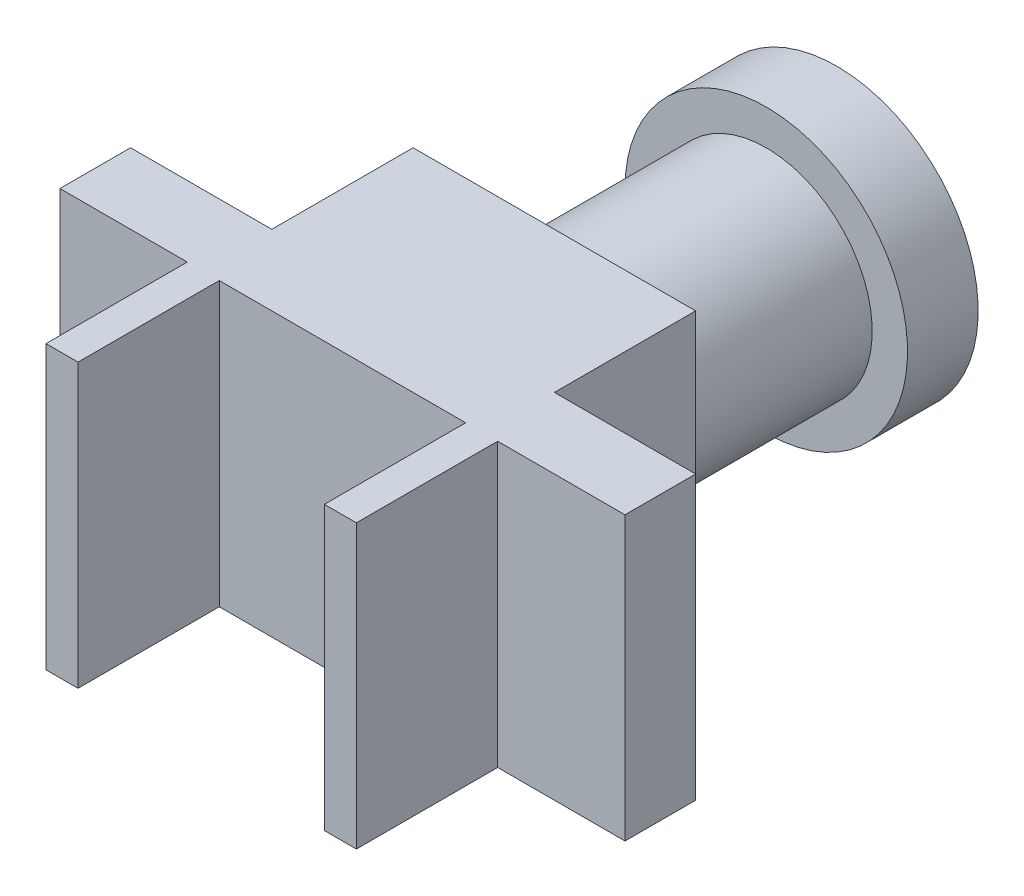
ISO-10303-21;
HEADER;
FILE_DESCRIPTION(('STEP AP214'),'2;1');
FILE_NAME('part.step','',(''),(''),'','','');
FILE_SCHEMA(('AUTOMOTIVE_DESIGN { 1 0 10303 214 1 1 1 1 }'));
ENDSEC;
DATA;
#1=APPLICATION_CONTEXT('core data for automotive mechanical design processes');
#2=APPLICATION_PROTOCOL_DEFINITION('international standard','automotive_design',2000,#1);
#3=PRODUCT_CONTEXT('',#1,'mechanical');
#4=PRODUCT('Part','Part','',(#3));
#5=PRODUCT_RELATED_PRODUCT_CATEGORY('part','',(#4));
#6=PRODUCT_DEFINITION_FORMATION('','',#4);
#7=PRODUCT_DEFINITION_CONTEXT('part definition',#1,'design');
#8=PRODUCT_DEFINITION('design','',#6,#7);
#9=PRODUCT_DEFINITION_SHAPE('','',#8);
#10=(LENGTH_UNIT() NAMED_UNIT(*) SI_UNIT(.MILLI.,.METRE.));
#11=(NAMED_UNIT(*) PLANE_ANGLE_UNIT() SI_UNIT($,.RADIAN.));
#12=(NAMED_UNIT(*) SI_UNIT($,.STERADIAN.) SOLID_ANGLE_UNIT());
#13=UNCERTAINTY_MEASURE_WITH_UNIT(LENGTH_MEASURE(1.E-05),#10,'distance_accuracy_value','');
#14=(GEOMETRIC_REPRESENTATION_CONTEXT(3) GLOBAL_UNCERTAINTY_ASSIGNED_CONTEXT((#13)) GLOBAL_UNIT_ASSIGNED_CONTEXT((#10,
#11,#12)) REPRESENTATION_CONTEXT('',''));
#15=CARTESIAN_POINT('',(0.,0.,0.));
#16=DIRECTION('',(0.,0.,1.));
#17=DIRECTION('',(1.,0.,0.));
#18=AXIS2_PLACEMENT_3D('',#15,#16,#17);
#19=CARTESIAN_POINT('',(0.,0.,45.));
#20=DIRECTION('',(0.,0.,-1.));
#21=DIRECTION('',(-1.,0.,0.));
#22=AXIS2_PLACEMENT_3D('',#19,#20,#21);
#23=PLANE('',#22);
#24=DIRECTION('',(-1.,0.,0.));
#25=VECTOR('',#24,1.);
#26=CARTESIAN_POINT('',(40.,20.,45.));
#27=LINE('',#26,#25);
#28=CARTESIAN_POINT('',(40.,20.,45.));
#29=VERTEX_POINT('',#28);
#30=CARTESIAN_POINT('',(21.9709349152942,20.,45.));
#31=VERTEX_POINT('',#30);
#32=EDGE_CURVE('E213',#29,#31,#27,.T.);
#33=ORIENTED_EDGE('',*,*,#32,.T.);
#34=DIRECTION('',(0.,-1.,0.));
#35=VECTOR('',#34,1.);
#36=CARTESIAN_POINT('',(21.9709349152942,20.,45.));
#37=LINE('',#36,#35);
#38=CARTESIAN_POINT('',(21.9709349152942,-20.,45.));
#39=VERTEX_POINT('',#38);
#40=EDGE_CURVE('E51',#31,#39,#37,.T.);
#41=ORIENTED_EDGE('',*,*,#40,.T.);
#42=DIRECTION('',(1.,0.,0.));
#43=VECTOR('',#42,1.);
#44=CARTESIAN_POINT('',(40.,-20.,45.));
#45=LINE('',#44,#43);
#46=CARTESIAN_POINT('',(40.,-20.,45.));
#47=VERTEX_POINT('',#46);
#48=EDGE_CURVE('E37',#39,#47,#45,.T.);
#49=ORIENTED_EDGE('',*,*,#48,.T.);
#50=DIRECTION('',(0.,1.,0.));
#51=VECTOR('',#50,1.);
#52=CARTESIAN_POINT('',(40.,20.,45.));
#53=LINE('',#52,#51);
#54=EDGE_CURVE('E218',#47,#29,#53,.T.);
#55=ORIENTED_EDGE('',*,*,#54,.T.);
#56=EDGE_LOOP('',(#33,#41,#49,#55));
#57=FACE_BOUND('',#56,.T.);
#58=ADVANCED_FACE('F33',(#57),#23,.F.);
#59=DIRECTION('',(0.,-1.,0.));
#60=VECTOR('',#59,1.);
#61=CARTESIAN_POINT('',(-21.9709349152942,20.,45.));
#62=LINE('',#61,#60);
#63=CARTESIAN_POINT('',(-21.9709349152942,20.,45.));
#64=VERTEX_POINT('',#63);
#65=CARTESIAN_POINT('',(-21.9709349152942,-20.,45.));
#66=VERTEX_POINT('',#65);
#67=EDGE_CURVE('E159',#64,#66,#62,.T.);
#68=ORIENTED_EDGE('',*,*,#67,.F.);
#69=CARTESIAN_POINT('',(-40.,20.,45.));
#70=VERTEX_POINT('',#69);
#71=EDGE_CURVE('E214',#64,#70,#27,.T.);
#72=ORIENTED_EDGE('',*,*,#71,.T.);
#73=DIRECTION('',(0.,-1.,0.));
#74=VECTOR('',#73,1.);
#75=CARTESIAN_POINT('',(-40.,20.,45.));
#76=LINE('',#75,#74);
#77=CARTESIAN_POINT('',(-40.,-20.,45.));
#78=VERTEX_POINT('',#77);
#79=EDGE_CURVE('E232',#70,#78,#76,.T.);
#80=ORIENTED_EDGE('',*,*,#79,.T.);
#81=EDGE_CURVE('E229',#78,#66,#45,.T.);
#82=ORIENTED_EDGE('',*,*,#81,.T.);
#83=EDGE_LOOP('',(#68,#72,#80,#82));
#84=FACE_BOUND('',#83,.T.);
#85=ADVANCED_FACE('F371',(#84),#23,.F.);
#86=CARTESIAN_POINT('',(-17.4394295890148,-20.,45.));
#87=VERTEX_POINT('',#86);
#88=CARTESIAN_POINT('',(17.4394295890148,-20.,45.));
#89=VERTEX_POINT('',#88);
#90=EDGE_CURVE('E59',#87,#89,#45,.T.);
#91=ORIENTED_EDGE('',*,*,#90,.T.);
#92=DIRECTION('',(0.,1.,0.));
#93=VECTOR('',#92,1.);
#94=CARTESIAN_POINT('',(17.4394295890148,20.,45.));
#95=LINE('',#94,#93);
#96=CARTESIAN_POINT('',(17.4394295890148,20.,45.));
#97=VERTEX_POINT('',#96);
#98=EDGE_CURVE('E170',#89,#97,#95,.T.);
#99=ORIENTED_EDGE('',*,*,#98,.T.);
#100=CARTESIAN_POINT('',(-17.4394295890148,20.,45.));
#101=VERTEX_POINT('',#100);
#102=EDGE_CURVE('E211',#97,#101,#27,.T.);
#103=ORIENTED_EDGE('',*,*,#102,.T.);
#104=DIRECTION('',(0.,1.,0.));
#105=VECTOR('',#104,1.);
#106=CARTESIAN_POINT('',(-17.4394295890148,20.,45.));
#107=LINE('',#106,#105);
#108=EDGE_CURVE('E190',#87,#101,#107,.T.);
#109=ORIENTED_EDGE('',*,*,#108,.F.);
#110=EDGE_LOOP('',(#91,#99,#103,#109));
#111=FACE_BOUND('',#110,.T.);
#112=ADVANCED_FACE('F369',(#111),#23,.F.);
#113=CARTESIAN_POINT('',(0.,0.,15.));
#114=DIRECTION('',(0.,0.,-1.));
#115=DIRECTION('',(-1.,0.,0.));
#116=AXIS2_PLACEMENT_3D('',#113,#114,#115);
#117=CYLINDRICAL_SURFACE('',#116,15.);
#118=CARTESIAN_POINT('',(0.,0.,15.));
#119=DIRECTION('',(0.,0.,1.));
#120=DIRECTION('',(1.,0.,0.));
#121=AXIS2_PLACEMENT_3D('',#118,#119,#120);
#122=CIRCLE('',#121,15.);
#123=CARTESIAN_POINT('',(15.,0.,15.));
#124=VERTEX_POINT('',#123);
#125=EDGE_CURVE('E11',#124,#124,#122,.T.);
#126=ORIENTED_EDGE('',*,*,#125,.F.);
#127=EDGE_LOOP('',(#126));
#128=FACE_BOUND('',#127,.T.);
#129=CARTESIAN_POINT('',(0.,0.,-15.));
#130=DIRECTION('',(0.,0.,-1.));
#131=DIRECTION('',(-1.,0.,0.));
#132=AXIS2_PLACEMENT_3D('',#129,#130,#131);
#133=CIRCLE('',#132,15.);
#134=CARTESIAN_POINT('',(-15.,0.,-15.));
#135=VERTEX_POINT('',#134);
#136=EDGE_CURVE('E43',#135,#135,#133,.T.);
#137=ORIENTED_EDGE('',*,*,#136,.F.);
#138=EDGE_LOOP('',(#137));
#139=FACE_BOUND('',#138,.T.);
#140=ADVANCED_FACE('F35',(#128,#139),#117,.T.);
#141=CARTESIAN_POINT('',(0.,0.,-15.));
#142=DIRECTION('',(0.,0.,-1.));
#143=DIRECTION('',(-1.,0.,0.));
#144=AXIS2_PLACEMENT_3D('',#141,#142,#143);
#145=PLANE('',#144);
#146=CARTESIAN_POINT('',(0.,0.,-15.));
#147=DIRECTION('',(0.,0.,-1.));
#148=DIRECTION('',(-1.,0.,0.));
#149=AXIS2_PLACEMENT_3D('',#146,#147,#148);
#150=CIRCLE('',#149,20.);
#151=CARTESIAN_POINT('',(-20.,0.,-15.));
#152=VERTEX_POINT('',#151);
#153=EDGE_CURVE('E290',#152,#152,#150,.T.);
#154=ORIENTED_EDGE('',*,*,#153,.F.);
#155=EDGE_LOOP('',(#154));
#156=FACE_BOUND('',#155,.T.);
#157=ORIENTED_EDGE('',*,*,#136,.T.);
#158=EDGE_LOOP('',(#157));
#159=FACE_BOUND('',#158,.T.);
#160=ADVANCED_FACE('F377',(#156,#159),#145,.F.);
#161=CARTESIAN_POINT('',(0.,0.,-25.));
#162=DIRECTION('',(0.,0.,1.));
#163=DIRECTION('',(1.,0.,0.));
#164=AXIS2_PLACEMENT_3D('',#161,#162,#163);
#165=CYLINDRICAL_SURFACE('',#164,20.);
#166=CARTESIAN_POINT('',(0.,0.,-25.));
#167=DIRECTION('',(0.,0.,-1.));
#168=DIRECTION('',(-1.,0.,0.));
#169=AXIS2_PLACEMENT_3D('',#166,#167,#168);
#170=CIRCLE('',#169,20.);
#171=CARTESIAN_POINT('',(-20.,0.,-25.));
#172=VERTEX_POINT('',#171);
#173=EDGE_CURVE('E287',#172,#172,#170,.T.);
#174=ORIENTED_EDGE('',*,*,#173,.F.);
#175=EDGE_LOOP('',(#174));
#176=FACE_BOUND('',#175,.T.);
#177=ORIENTED_EDGE('',*,*,#153,.T.);
#178=EDGE_LOOP('',(#177));
#179=FACE_BOUND('',#178,.T.);
#180=ADVANCED_FACE('F500',(#176,#179),#165,.T.);
#181=CARTESIAN_POINT('',(0.,0.,-25.));
#182=DIRECTION('',(0.,0.,-1.));
#183=DIRECTION('',(-1.,0.,0.));
#184=AXIS2_PLACEMENT_3D('',#181,#182,#183);
#185=PLANE('',#184);
#186=ORIENTED_EDGE('',*,*,#173,.T.);
#187=EDGE_LOOP('',(#186));
#188=FACE_BOUND('',#187,.T.);
#189=ADVANCED_FACE('F491',(#188),#185,.T.);
#190=CARTESIAN_POINT('',(0.,0.,15.));
#191=DIRECTION('',(0.,0.,-1.));
#192=DIRECTION('',(-1.,0.,0.));
#193=AXIS2_PLACEMENT_3D('',#190,#191,#192);
#194=PLANE('',#193);
#195=DIRECTION('',(0.,-1.,0.));
#196=VECTOR('',#195,1.);
#197=CARTESIAN_POINT('',(-20.,20.,15.));
#198=LINE('',#197,#196);
#199=CARTESIAN_POINT('',(-20.,20.,15.));
#200=VERTEX_POINT('',#199);
#201=CARTESIAN_POINT('',(-20.,-20.,15.));
#202=VERTEX_POINT('',#201);
#203=EDGE_CURVE('E267',#200,#202,#198,.T.);
#204=ORIENTED_EDGE('',*,*,#203,.F.);
#205=DIRECTION('',(-1.,0.,0.));
#206=VECTOR('',#205,1.);
#207=CARTESIAN_POINT('',(20.,20.,15.));
#208=LINE('',#207,#206);
#209=CARTESIAN_POINT('',(20.,20.,15.));
#210=VERTEX_POINT('',#209);
#211=EDGE_CURVE('E284',#210,#200,#208,.T.);
#212=ORIENTED_EDGE('',*,*,#211,.F.);
#213=DIRECTION('',(0.,1.,0.));
#214=VECTOR('',#213,1.);
#215=CARTESIAN_POINT('',(20.,20.,15.));
#216=LINE('',#215,#214);
#217=CARTESIAN_POINT('',(20.,-20.,15.));
#218=VERTEX_POINT('',#217);
#219=EDGE_CURVE('E277',#218,#210,#216,.T.);
#220=ORIENTED_EDGE('',*,*,#219,.F.);
#221=DIRECTION('',(1.,0.,0.));
#222=VECTOR('',#221,1.);
#223=CARTESIAN_POINT('',(20.,-20.,15.));
#224=LINE('',#223,#222);
#225=EDGE_CURVE('E272',#202,#218,#224,.T.);
#226=ORIENTED_EDGE('',*,*,#225,.F.);
#227=EDGE_LOOP('',(#204,#212,#220,#226));
#228=FACE_BOUND('',#227,.T.);
#229=ORIENTED_EDGE('',*,*,#125,.T.);
#230=EDGE_LOOP('',(#229));
#231=FACE_BOUND('',#230,.T.);
#232=ADVANCED_FACE('F330',(#228,#231),#194,.T.);
#233=CARTESIAN_POINT('',(-20.,20.,35.));
#234=DIRECTION('',(1.,0.,0.));
#235=DIRECTION('',(0.,1.,0.));
#236=AXIS2_PLACEMENT_3D('',#233,#234,#235);
#237=PLANE('',#236);
#238=ORIENTED_EDGE('',*,*,#203,.T.);
#239=DIRECTION('',(0.,0.,-1.));
#240=VECTOR('',#239,1.);
#241=CARTESIAN_POINT('',(-20.,-20.,35.));
#242=LINE('',#241,#240);
#243=CARTESIAN_POINT('',(-20.,-20.,35.));
#244=VERTEX_POINT('',#243);
#245=EDGE_CURVE('E293',#244,#202,#242,.T.);
#246=ORIENTED_EDGE('',*,*,#245,.F.);
#247=DIRECTION('',(0.,-1.,0.));
#248=VECTOR('',#247,1.);
#249=CARTESIAN_POINT('',(-20.,20.,35.));
#250=LINE('',#249,#248);
#251=CARTESIAN_POINT('',(-20.,20.,35.));
#252=VERTEX_POINT('',#251);
#253=EDGE_CURVE('E286',#252,#244,#250,.T.);
#254=ORIENTED_EDGE('',*,*,#253,.F.);
#255=DIRECTION('',(0.,0.,-1.));
#256=VECTOR('',#255,1.);
#257=CARTESIAN_POINT('',(-20.,20.,35.));
#258=LINE('',#257,#256);
#259=EDGE_CURVE('E299',#252,#200,#258,.T.);
#260=ORIENTED_EDGE('',*,*,#259,.T.);
#261=EDGE_LOOP('',(#238,#246,#254,#260));
#262=FACE_BOUND('',#261,.T.);
#263=ADVANCED_FACE('F334',(#262),#237,.F.);
#264=CARTESIAN_POINT('',(20.,-20.,35.));
#265=DIRECTION('',(0.,1.,0.));
#266=DIRECTION('',(-1.,0.,0.));
#267=AXIS2_PLACEMENT_3D('',#264,#265,#266);
#268=PLANE('',#267);
#269=ORIENTED_EDGE('',*,*,#225,.T.);
#270=DIRECTION('',(0.,0.,-1.));
#271=VECTOR('',#270,1.);
#272=CARTESIAN_POINT('',(20.,-20.,35.));
#273=LINE('',#272,#271);
#274=CARTESIAN_POINT('',(20.,-20.,35.));
#275=VERTEX_POINT('',#274);
#276=EDGE_CURVE('E298',#275,#218,#273,.T.);
#277=ORIENTED_EDGE('',*,*,#276,.F.);
#278=DIRECTION('',(1.,0.,0.));
#279=VECTOR('',#278,1.);
#280=CARTESIAN_POINT('',(40.,-20.,35.));
#281=LINE('',#280,#279);
#282=CARTESIAN_POINT('',(40.,-20.,35.));
#283=VERTEX_POINT('',#282);
#284=EDGE_CURVE('E314',#275,#283,#281,.T.);
#285=ORIENTED_EDGE('',*,*,#284,.T.);
#286=DIRECTION('',(0.,0.,-1.));
#287=VECTOR('',#286,1.);
#288=CARTESIAN_POINT('',(40.,-20.,45.));
#289=LINE('',#288,#287);
#290=EDGE_CURVE('E260',#47,#283,#289,.T.);
#291=ORIENTED_EDGE('',*,*,#290,.F.);
#292=ORIENTED_EDGE('',*,*,#48,.F.);
#293=DIRECTION('',(0.,0.,-1.));
#294=VECTOR('',#293,1.);
#295=CARTESIAN_POINT('',(21.9709349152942,-20.,65.));
#296=LINE('',#295,#294);
#297=CARTESIAN_POINT('',(21.9709349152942,-20.,65.));
#298=VERTEX_POINT('',#297);
#299=EDGE_CURVE('E179',#298,#39,#296,.T.);
#300=ORIENTED_EDGE('',*,*,#299,.F.);
#301=DIRECTION('',(-1.,0.,0.));
#302=VECTOR('',#301,1.);
#303=CARTESIAN_POINT('',(21.9709349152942,-20.,65.));
#304=LINE('',#303,#302);
#305=CARTESIAN_POINT('',(17.4394295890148,-20.,65.));
#306=VERTEX_POINT('',#305);
#307=EDGE_CURVE('E169',#298,#306,#304,.T.);
#308=ORIENTED_EDGE('',*,*,#307,.T.);
#309=DIRECTION('',(0.,0.,-1.));
#310=VECTOR('',#309,1.);
#311=CARTESIAN_POINT('',(17.4394295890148,-20.,65.));
#312=LINE('',#311,#310);
#313=EDGE_CURVE('E183',#306,#89,#312,.T.);
#314=ORIENTED_EDGE('',*,*,#313,.T.);
#315=ORIENTED_EDGE('',*,*,#90,.F.);
#316=DIRECTION('',(0.,0.,-1.));
#317=VECTOR('',#316,1.);
#318=CARTESIAN_POINT('',(-17.4394295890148,-20.,65.));
#319=LINE('',#318,#317);
#320=CARTESIAN_POINT('',(-17.4394295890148,-20.,65.));
#321=VERTEX_POINT('',#320);
#322=EDGE_CURVE('E345',#321,#87,#319,.T.);
#323=ORIENTED_EDGE('',*,*,#322,.F.);
#324=DIRECTION('',(1.,0.,0.));
#325=VECTOR('',#324,1.);
#326=CARTESIAN_POINT('',(-21.9709349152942,-20.,65.));
#327=LINE('',#326,#325);
#328=CARTESIAN_POINT('',(-21.9709349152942,-20.,65.));
#329=VERTEX_POINT('',#328);
#330=EDGE_CURVE('E189',#329,#321,#327,.T.);
#331=ORIENTED_EDGE('',*,*,#330,.F.);
#332=DIRECTION('',(0.,0.,-1.));
#333=VECTOR('',#332,1.);
#334=CARTESIAN_POINT('',(-21.9709349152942,-20.,65.));
#335=LINE('',#334,#333);
#336=EDGE_CURVE('E343',#329,#66,#335,.T.);
#337=ORIENTED_EDGE('',*,*,#336,.T.);
#338=ORIENTED_EDGE('',*,*,#81,.F.);
#339=DIRECTION('',(0.,0.,-1.));
#340=VECTOR('',#339,1.);
#341=CARTESIAN_POINT('',(-40.,-20.,45.));
#342=LINE('',#341,#340);
#343=CARTESIAN_POINT('',(-40.,-20.,35.));
#344=VERTEX_POINT('',#343);
#345=EDGE_CURVE('E250',#78,#344,#342,.T.);
#346=ORIENTED_EDGE('',*,*,#345,.T.);
#347=EDGE_CURVE('E315',#344,#244,#281,.T.);
#348=ORIENTED_EDGE('',*,*,#347,.T.);
#349=ORIENTED_EDGE('',*,*,#245,.T.);
#350=EDGE_LOOP('',(#269,#277,#285,#291,#292,#300,#308,#314,#315,#323,#331,#337,#338,#346,#348,#349));
#351=FACE_BOUND('',#350,.T.);
#352=ADVANCED_FACE('F332',(#351),#268,.F.);
#353=CARTESIAN_POINT('',(20.,20.,35.));
#354=DIRECTION('',(-1.,0.,0.));
#355=DIRECTION('',(0.,-1.,0.));
#356=AXIS2_PLACEMENT_3D('',#353,#354,#355);
#357=PLANE('',#356);
#358=ORIENTED_EDGE('',*,*,#219,.T.);
#359=DIRECTION('',(0.,0.,-1.));
#360=VECTOR('',#359,1.);
#361=CARTESIAN_POINT('',(20.,20.,35.));
#362=LINE('',#361,#360);
#363=CARTESIAN_POINT('',(20.,20.,35.));
#364=VERTEX_POINT('',#363);
#365=EDGE_CURVE('E296',#364,#210,#362,.T.);
#366=ORIENTED_EDGE('',*,*,#365,.F.);
#367=DIRECTION('',(0.,1.,0.));
#368=VECTOR('',#367,1.);
#369=CARTESIAN_POINT('',(20.,20.,35.));
#370=LINE('',#369,#368);
#371=EDGE_CURVE('E302',#275,#364,#370,.T.);
#372=ORIENTED_EDGE('',*,*,#371,.F.);
#373=ORIENTED_EDGE('',*,*,#276,.T.);
#374=EDGE_LOOP('',(#358,#366,#372,#373));
#375=FACE_BOUND('',#374,.T.);
#376=ADVANCED_FACE('F326',(#375),#357,.F.);
#377=CARTESIAN_POINT('',(20.,20.,35.));
#378=DIRECTION('',(0.,-1.,0.));
#379=DIRECTION('',(1.,0.,0.));
#380=AXIS2_PLACEMENT_3D('',#377,#378,#379);
#381=PLANE('',#380);
#382=ORIENTED_EDGE('',*,*,#211,.T.);
#383=ORIENTED_EDGE('',*,*,#259,.F.);
#384=DIRECTION('',(-1.,0.,0.));
#385=VECTOR('',#384,1.);
#386=CARTESIAN_POINT('',(40.,20.,35.));
#387=LINE('',#386,#385);
#388=CARTESIAN_POINT('',(-40.,20.,35.));
#389=VERTEX_POINT('',#388);
#390=EDGE_CURVE('E241',#252,#389,#387,.T.);
#391=ORIENTED_EDGE('',*,*,#390,.T.);
#392=DIRECTION('',(0.,0.,-1.));
#393=VECTOR('',#392,1.);
#394=CARTESIAN_POINT('',(-40.,20.,45.));
#395=LINE('',#394,#393);
#396=EDGE_CURVE('E227',#70,#389,#395,.T.);
#397=ORIENTED_EDGE('',*,*,#396,.F.);
#398=ORIENTED_EDGE('',*,*,#71,.F.);
#399=DIRECTION('',(0.,0.,-1.));
#400=VECTOR('',#399,1.);
#401=CARTESIAN_POINT('',(-21.9709349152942,20.,65.));
#402=LINE('',#401,#400);
#403=CARTESIAN_POINT('',(-21.9709349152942,20.,65.));
#404=VERTEX_POINT('',#403);
#405=EDGE_CURVE('E196',#404,#64,#402,.T.);
#406=ORIENTED_EDGE('',*,*,#405,.F.);
#407=DIRECTION('',(-1.,0.,0.));
#408=VECTOR('',#407,1.);
#409=CARTESIAN_POINT('',(-21.9709349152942,20.,65.));
#410=LINE('',#409,#408);
#411=CARTESIAN_POINT('',(-17.4394295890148,20.,65.));
#412=VERTEX_POINT('',#411);
#413=EDGE_CURVE('E194',#412,#404,#410,.T.);
#414=ORIENTED_EDGE('',*,*,#413,.F.);
#415=DIRECTION('',(0.,0.,-1.));
#416=VECTOR('',#415,1.);
#417=CARTESIAN_POINT('',(-17.4394295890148,20.,65.));
#418=LINE('',#417,#416);
#419=EDGE_CURVE('E209',#412,#101,#418,.T.);
#420=ORIENTED_EDGE('',*,*,#419,.T.);
#421=ORIENTED_EDGE('',*,*,#102,.F.);
#422=DIRECTION('',(0.,0.,-1.));
#423=VECTOR('',#422,1.);
#424=CARTESIAN_POINT('',(17.4394295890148,20.,65.));
#425=LINE('',#424,#423);
#426=CARTESIAN_POINT('',(17.4394295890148,20.,65.));
#427=VERTEX_POINT('',#426);
#428=EDGE_CURVE('E160',#427,#97,#425,.T.);
#429=ORIENTED_EDGE('',*,*,#428,.F.);
#430=DIRECTION('',(1.,0.,0.));
#431=VECTOR('',#430,1.);
#432=CARTESIAN_POINT('',(21.9709349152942,20.,65.));
#433=LINE('',#432,#431);
#434=CARTESIAN_POINT('',(21.9709349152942,20.,65.));
#435=VERTEX_POINT('',#434);
#436=EDGE_CURVE('E166',#427,#435,#433,.T.);
#437=ORIENTED_EDGE('',*,*,#436,.T.);
#438=DIRECTION('',(0.,0.,-1.));
#439=VECTOR('',#438,1.);
#440=CARTESIAN_POINT('',(21.9709349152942,20.,65.));
#441=LINE('',#440,#439);
#442=EDGE_CURVE('E150',#435,#31,#441,.T.);
#443=ORIENTED_EDGE('',*,*,#442,.T.);
#444=ORIENTED_EDGE('',*,*,#32,.F.);
#445=DIRECTION('',(0.,0.,-1.));
#446=VECTOR('',#445,1.);
#447=CARTESIAN_POINT('',(40.,20.,45.));
#448=LINE('',#447,#446);
#449=CARTESIAN_POINT('',(40.,20.,35.));
#450=VERTEX_POINT('',#449);
#451=EDGE_CURVE('E259',#29,#450,#448,.T.);
#452=ORIENTED_EDGE('',*,*,#451,.T.);
#453=EDGE_CURVE('E236',#450,#364,#387,.T.);
#454=ORIENTED_EDGE('',*,*,#453,.T.);
#455=ORIENTED_EDGE('',*,*,#365,.T.);
#456=EDGE_LOOP('',(#382,#383,#391,#397,#398,#406,#414,#420,#421,#429,#437,#443,#444,#452,#454,#455));
#457=FACE_BOUND('',#456,.T.);
#458=ADVANCED_FACE('F172',(#457),#381,.F.);
#459=CARTESIAN_POINT('',(0.,0.,35.));
#460=DIRECTION('',(0.,0.,-1.));
#461=DIRECTION('',(-1.,0.,0.));
#462=AXIS2_PLACEMENT_3D('',#459,#460,#461);
#463=PLANE('',#462);
#464=ORIENTED_EDGE('',*,*,#390,.F.);
#465=ORIENTED_EDGE('',*,*,#253,.T.);
#466=ORIENTED_EDGE('',*,*,#347,.F.);
#467=DIRECTION('',(0.,-1.,0.));
#468=VECTOR('',#467,1.);
#469=CARTESIAN_POINT('',(-40.,20.,35.));
#470=LINE('',#469,#468);
#471=EDGE_CURVE('E219',#389,#344,#470,.T.);
#472=ORIENTED_EDGE('',*,*,#471,.F.);
#473=EDGE_LOOP('',(#464,#465,#466,#472));
#474=FACE_BOUND('',#473,.T.);
#475=ADVANCED_FACE('F337',(#474),#463,.T.);
#476=CARTESIAN_POINT('',(-40.,20.,45.));
#477=DIRECTION('',(1.,0.,0.));
#478=DIRECTION('',(0.,1.,0.));
#479=AXIS2_PLACEMENT_3D('',#476,#477,#478);
#480=PLANE('',#479);
#481=ORIENTED_EDGE('',*,*,#471,.T.);
#482=ORIENTED_EDGE('',*,*,#345,.F.);
#483=ORIENTED_EDGE('',*,*,#79,.F.);
#484=ORIENTED_EDGE('',*,*,#396,.T.);
#485=EDGE_LOOP('',(#481,#482,#483,#484));
#486=FACE_BOUND('',#485,.T.);
#487=ADVANCED_FACE('F342',(#486),#480,.F.);
#488=CARTESIAN_POINT('',(40.,20.,45.));
#489=DIRECTION('',(-1.,0.,0.));
#490=DIRECTION('',(0.,-1.,0.));
#491=AXIS2_PLACEMENT_3D('',#488,#489,#490);
#492=PLANE('',#491);
#493=DIRECTION('',(0.,1.,0.));
#494=VECTOR('',#493,1.);
#495=CARTESIAN_POINT('',(40.,20.,35.));
#496=LINE('',#495,#494);
#497=EDGE_CURVE('E246',#283,#450,#496,.T.);
#498=ORIENTED_EDGE('',*,*,#497,.T.);
#499=ORIENTED_EDGE('',*,*,#451,.F.);
#500=ORIENTED_EDGE('',*,*,#54,.F.);
#501=ORIENTED_EDGE('',*,*,#290,.T.);
#502=EDGE_LOOP('',(#498,#499,#500,#501));
#503=FACE_BOUND('',#502,.T.);
#504=ADVANCED_FACE('F320',(#503),#492,.F.);
#505=ORIENTED_EDGE('',*,*,#284,.F.);
#506=ORIENTED_EDGE('',*,*,#371,.T.);
#507=ORIENTED_EDGE('',*,*,#453,.F.);
#508=ORIENTED_EDGE('',*,*,#497,.F.);
#509=EDGE_LOOP('',(#505,#506,#507,#508));
#510=FACE_BOUND('',#509,.T.);
#511=ADVANCED_FACE('F323',(#510),#463,.T.);
#512=CARTESIAN_POINT('',(-21.9709349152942,20.,65.));
#513=DIRECTION('',(1.,0.,0.));
#514=DIRECTION('',(0.,0.,-1.));
#515=AXIS2_PLACEMENT_3D('',#512,#513,#514);
#516=PLANE('',#515);
#517=ORIENTED_EDGE('',*,*,#67,.T.);
#518=ORIENTED_EDGE('',*,*,#336,.F.);
#519=DIRECTION('',(0.,-1.,0.));
#520=VECTOR('',#519,1.);
#521=CARTESIAN_POINT('',(-21.9709349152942,20.,65.));
#522=LINE('',#521,#520);
#523=EDGE_CURVE('E186',#404,#329,#522,.T.);
#524=ORIENTED_EDGE('',*,*,#523,.F.);
#525=ORIENTED_EDGE('',*,*,#405,.T.);
#526=EDGE_LOOP('',(#517,#518,#524,#525));
#527=FACE_BOUND('',#526,.T.);
#528=ADVANCED_FACE('F385',(#527),#516,.F.);
#529=CARTESIAN_POINT('',(-17.4394295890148,20.,65.));
#530=DIRECTION('',(-1.,0.,0.));
#531=DIRECTION('',(0.,0.,1.));
#532=AXIS2_PLACEMENT_3D('',#529,#530,#531);
#533=PLANE('',#532);
#534=ORIENTED_EDGE('',*,*,#108,.T.);
#535=ORIENTED_EDGE('',*,*,#419,.F.);
#536=DIRECTION('',(0.,1.,0.));
#537=VECTOR('',#536,1.);
#538=CARTESIAN_POINT('',(-17.4394295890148,20.,65.));
#539=LINE('',#538,#537);
#540=EDGE_CURVE('E192',#321,#412,#539,.T.);
#541=ORIENTED_EDGE('',*,*,#540,.F.);
#542=ORIENTED_EDGE('',*,*,#322,.T.);
#543=EDGE_LOOP('',(#534,#535,#541,#542));
#544=FACE_BOUND('',#543,.T.);
#545=ADVANCED_FACE('F358',(#544),#533,.F.);
#546=CARTESIAN_POINT('',(0.,0.,65.));
#547=DIRECTION('',(0.,0.,1.));
#548=DIRECTION('',(1.,0.,0.));
#549=AXIS2_PLACEMENT_3D('',#546,#547,#548);
#550=PLANE('',#549);
#551=ORIENTED_EDGE('',*,*,#523,.T.);
#552=ORIENTED_EDGE('',*,*,#330,.T.);
#553=ORIENTED_EDGE('',*,*,#540,.T.);
#554=ORIENTED_EDGE('',*,*,#413,.T.);
#555=EDGE_LOOP('',(#551,#552,#553,#554));
#556=FACE_BOUND('',#555,.T.);
#557=ADVANCED_FACE('F365',(#556),#550,.T.);
#558=CARTESIAN_POINT('',(21.9709349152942,20.,65.));
#559=DIRECTION('',(1.,0.,0.));
#560=DIRECTION('',(0.,0.,-1.));
#561=AXIS2_PLACEMENT_3D('',#558,#559,#560);
#562=PLANE('',#561);
#563=ORIENTED_EDGE('',*,*,#40,.F.);
#564=ORIENTED_EDGE('',*,*,#442,.F.);
#565=DIRECTION('',(0.,-1.,0.));
#566=VECTOR('',#565,1.);
#567=CARTESIAN_POINT('',(21.9709349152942,20.,65.));
#568=LINE('',#567,#566);
#569=EDGE_CURVE('E154',#435,#298,#568,.T.);
#570=ORIENTED_EDGE('',*,*,#569,.T.);
#571=ORIENTED_EDGE('',*,*,#299,.T.);
#572=EDGE_LOOP('',(#563,#564,#570,#571));
#573=FACE_BOUND('',#572,.T.);
#574=ADVANCED_FACE('F152',(#573),#562,.T.);
#575=CARTESIAN_POINT('',(17.4394295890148,20.,65.));
#576=DIRECTION('',(-1.,0.,0.));
#577=DIRECTION('',(0.,0.,1.));
#578=AXIS2_PLACEMENT_3D('',#575,#576,#577);
#579=PLANE('',#578);
#580=ORIENTED_EDGE('',*,*,#98,.F.);
#581=ORIENTED_EDGE('',*,*,#313,.F.);
#582=DIRECTION('',(0.,1.,0.));
#583=VECTOR('',#582,1.);
#584=CARTESIAN_POINT('',(17.4394295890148,20.,65.));
#585=LINE('',#584,#583);
#586=EDGE_CURVE('E174',#306,#427,#585,.T.);
#587=ORIENTED_EDGE('',*,*,#586,.T.);
#588=ORIENTED_EDGE('',*,*,#428,.T.);
#589=EDGE_LOOP('',(#580,#581,#587,#588));
#590=FACE_BOUND('',#589,.T.);
#591=ADVANCED_FACE('F368',(#590),#579,.T.);
#592=CARTESIAN_POINT('',(0.,0.,65.));
#593=DIRECTION('',(0.,0.,1.));
#594=DIRECTION('',(-1.,0.,0.));
#595=AXIS2_PLACEMENT_3D('',#592,#593,#594);
#596=PLANE('',#595);
#597=ORIENTED_EDGE('',*,*,#569,.F.);
#598=ORIENTED_EDGE('',*,*,#436,.F.);
#599=ORIENTED_EDGE('',*,*,#586,.F.);
#600=ORIENTED_EDGE('',*,*,#307,.F.);
#601=EDGE_LOOP('',(#597,#598,#599,#600));
#602=FACE_BOUND('',#601,.T.);
#603=ADVANCED_FACE('F164',(#602),#596,.T.);
#604=CLOSED_SHELL('',(#58,#85,#112,#140,#160,#180,#189,#232,#263,#352,#376,#458,#475,#487,#504,
#511,#528,#545,#557,#574,#591,#603));
#605=MANIFOLD_SOLID_BREP('B2',#604);
#606=ADVANCED_BREP_SHAPE_REPRESENTATION('',(#18,#605),#14);
#607=SHAPE_DEFINITION_REPRESENTATION(#9,#606);
ENDSEC;
END-ISO-10303-21;
